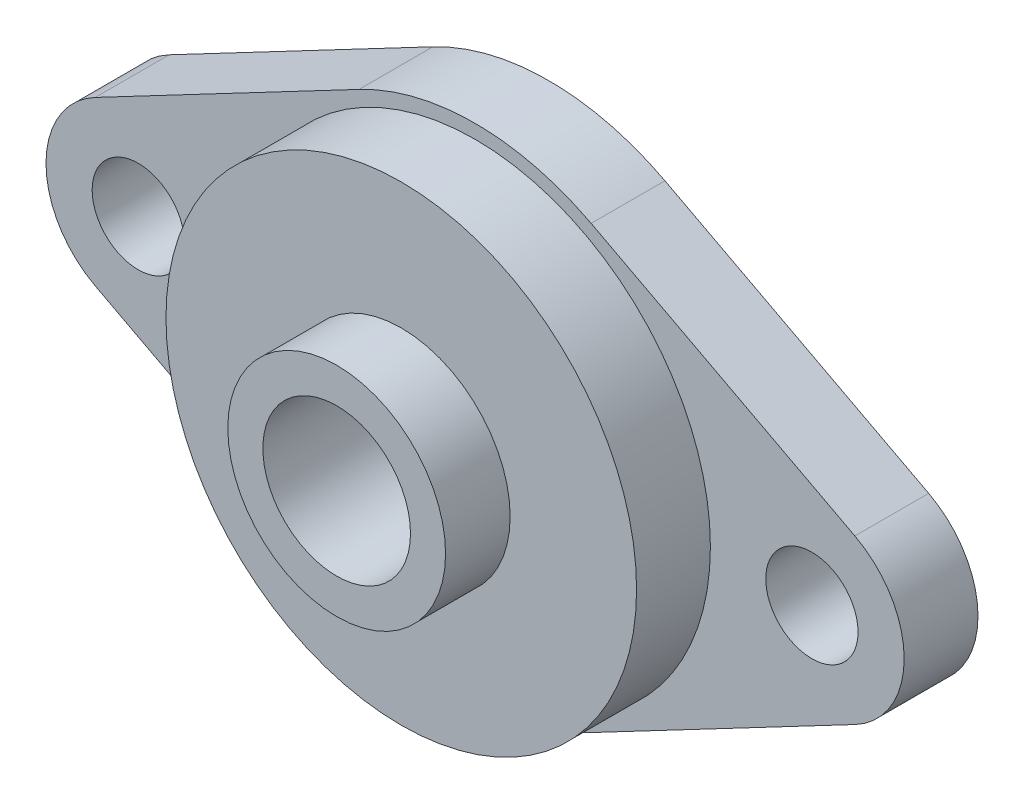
ISO-10303-21;
HEADER;
FILE_DESCRIPTION(('STEP AP214'),'2;1');
FILE_NAME('part.step','',(''),(''),'','','');
FILE_SCHEMA(('AUTOMOTIVE_DESIGN { 1 0 10303 214 1 1 1 1 }'));
ENDSEC;
DATA;
#1=APPLICATION_CONTEXT('core data for automotive mechanical design processes');
#2=APPLICATION_PROTOCOL_DEFINITION('international standard','automotive_design',2000,#1);
#3=PRODUCT_CONTEXT('',#1,'mechanical');
#4=PRODUCT('Part','Part','',(#3));
#5=PRODUCT_RELATED_PRODUCT_CATEGORY('part','',(#4));
#6=PRODUCT_DEFINITION_FORMATION('','',#4);
#7=PRODUCT_DEFINITION_CONTEXT('part definition',#1,'design');
#8=PRODUCT_DEFINITION('design','',#6,#7);
#9=PRODUCT_DEFINITION_SHAPE('','',#8);
#10=(LENGTH_UNIT() NAMED_UNIT(*) SI_UNIT(.MILLI.,.METRE.));
#11=(NAMED_UNIT(*) PLANE_ANGLE_UNIT() SI_UNIT($,.RADIAN.));
#12=(NAMED_UNIT(*) SI_UNIT($,.STERADIAN.) SOLID_ANGLE_UNIT());
#13=UNCERTAINTY_MEASURE_WITH_UNIT(LENGTH_MEASURE(1.E-05),#10,'distance_accuracy_value','');
#14=(GEOMETRIC_REPRESENTATION_CONTEXT(3) GLOBAL_UNCERTAINTY_ASSIGNED_CONTEXT((#13)) GLOBAL_UNIT_ASSIGNED_CONTEXT((#10,
#11,#12)) REPRESENTATION_CONTEXT('',''));
#15=CARTESIAN_POINT('',(0.,0.,0.));
#16=DIRECTION('',(0.,0.,1.));
#17=DIRECTION('',(1.,0.,0.));
#18=AXIS2_PLACEMENT_3D('',#15,#16,#17);
#19=CARTESIAN_POINT('',(0.,0.,8.));
#20=DIRECTION('',(0.,0.,1.));
#21=DIRECTION('',(1.,0.,0.));
#22=AXIS2_PLACEMENT_3D('',#19,#20,#21);
#23=PLANE('',#22);
#24=CARTESIAN_POINT('',(0.,0.,8.));
#25=DIRECTION('',(0.,0.,1.));
#26=DIRECTION('',(1.,0.,0.));
#27=AXIS2_PLACEMENT_3D('',#24,#25,#26);
#28=CIRCLE('',#27,12.75);
#29=CARTESIAN_POINT('',(12.75,0.,8.));
#30=VERTEX_POINT('',#29);
#31=EDGE_CURVE('E196',#30,#30,#28,.T.);
#32=ORIENTED_EDGE('',*,*,#31,.T.);
#33=EDGE_LOOP('',(#32));
#34=FACE_BOUND('',#33,.T.);
#35=CARTESIAN_POINT('',(0.,0.,8.));
#36=DIRECTION('',(0.,0.,1.));
#37=DIRECTION('',(1.,0.,0.));
#38=AXIS2_PLACEMENT_3D('',#35,#36,#37);
#39=CIRCLE('',#38,5.9);
#40=CARTESIAN_POINT('',(5.9,0.,8.));
#41=VERTEX_POINT('',#40);
#42=EDGE_CURVE('E202',#41,#41,#39,.T.);
#43=ORIENTED_EDGE('',*,*,#42,.F.);
#44=EDGE_LOOP('',(#43));
#45=FACE_BOUND('',#44,.T.);
#46=ADVANCED_FACE('F32',(#34,#45),#23,.T.);
#47=CARTESIAN_POINT('',(-18.25,0.,4.));
#48=DIRECTION('',(0.,0.,-1.));
#49=DIRECTION('',(-1.,0.,0.));
#50=AXIS2_PLACEMENT_3D('',#47,#48,#49);
#51=PLANE('',#50);
#52=CARTESIAN_POINT('',(-18.25,0.,4.));
#53=DIRECTION('',(0.,0.,1.));
#54=DIRECTION('',(-1.,0.,0.));
#55=AXIS2_PLACEMENT_3D('',#52,#53,#54);
#56=CIRCLE('',#55,2.5);
#57=CARTESIAN_POINT('',(-20.75,0.,4.));
#58=VERTEX_POINT('',#57);
#59=EDGE_CURVE('E190',#58,#58,#56,.T.);
#60=ORIENTED_EDGE('',*,*,#59,.F.);
#61=EDGE_LOOP('',(#60));
#62=FACE_BOUND('',#61,.T.);
#63=CARTESIAN_POINT('',(-18.25,0.,4.));
#64=DIRECTION('',(0.,0.,1.));
#65=DIRECTION('',(-1.,0.,0.));
#66=AXIS2_PLACEMENT_3D('',#63,#64,#65);
#67=CIRCLE('',#66,5.);
#68=CARTESIAN_POINT('',(-20.5787671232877,4.4245727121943,4.));
#69=VERTEX_POINT('',#68);
#70=CARTESIAN_POINT('',(-20.5787671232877,-4.4245727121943,4.));
#71=VERTEX_POINT('',#70);
#72=EDGE_CURVE('E146',#69,#71,#67,.T.);
#73=ORIENTED_EDGE('',*,*,#72,.T.);
#74=DIRECTION('',(0.884914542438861,-0.465753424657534,0.));
#75=VECTOR('',#74,1.);
#76=CARTESIAN_POINT('',(-6.28767123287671,-11.9463463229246,4.));
#77=LINE('',#76,#75);
#78=CARTESIAN_POINT('',(-6.28767123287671,-11.9463463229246,4.));
#79=VERTEX_POINT('',#78);
#80=EDGE_CURVE('E93',#71,#79,#77,.T.);
#81=ORIENTED_EDGE('',*,*,#80,.T.);
#82=CARTESIAN_POINT('',(0.,0.,4.));
#83=DIRECTION('',(0.,0.,1.));
#84=DIRECTION('',(1.,0.,0.));
#85=AXIS2_PLACEMENT_3D('',#82,#83,#84);
#86=CIRCLE('',#85,13.5);
#87=CARTESIAN_POINT('',(6.28767123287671,-11.9463463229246,4.));
#88=VERTEX_POINT('',#87);
#89=EDGE_CURVE('E178',#79,#88,#86,.T.);
#90=ORIENTED_EDGE('',*,*,#89,.T.);
#91=DIRECTION('',(0.884914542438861,0.465753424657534,0.));
#92=VECTOR('',#91,1.);
#93=CARTESIAN_POINT('',(6.28767123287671,-11.9463463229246,4.));
#94=LINE('',#93,#92);
#95=CARTESIAN_POINT('',(20.5787671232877,-4.4245727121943,4.));
#96=VERTEX_POINT('',#95);
#97=EDGE_CURVE('E177',#88,#96,#94,.T.);
#98=ORIENTED_EDGE('',*,*,#97,.T.);
#99=CARTESIAN_POINT('',(18.25,0.,4.));
#100=DIRECTION('',(0.,0.,1.));
#101=DIRECTION('',(1.,0.,0.));
#102=AXIS2_PLACEMENT_3D('',#99,#100,#101);
#103=CIRCLE('',#102,5.);
#104=CARTESIAN_POINT('',(20.5787671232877,4.4245727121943,4.));
#105=VERTEX_POINT('',#104);
#106=EDGE_CURVE('E113',#96,#105,#103,.T.);
#107=ORIENTED_EDGE('',*,*,#106,.T.);
#108=DIRECTION('',(-0.884914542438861,0.465753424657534,0.));
#109=VECTOR('',#108,1.);
#110=CARTESIAN_POINT('',(6.28767123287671,11.9463463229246,4.));
#111=LINE('',#110,#109);
#112=CARTESIAN_POINT('',(6.28767123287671,11.9463463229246,4.));
#113=VERTEX_POINT('',#112);
#114=EDGE_CURVE('E106',#105,#113,#111,.T.);
#115=ORIENTED_EDGE('',*,*,#114,.T.);
#116=CARTESIAN_POINT('',(0.,0.,4.));
#117=DIRECTION('',(0.,0.,1.));
#118=DIRECTION('',(1.,0.,0.));
#119=AXIS2_PLACEMENT_3D('',#116,#117,#118);
#120=CIRCLE('',#119,13.5);
#121=CARTESIAN_POINT('',(-6.28767123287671,11.9463463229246,4.));
#122=VERTEX_POINT('',#121);
#123=EDGE_CURVE('E111',#113,#122,#120,.T.);
#124=ORIENTED_EDGE('',*,*,#123,.T.);
#125=DIRECTION('',(-0.884914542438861,-0.465753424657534,0.));
#126=VECTOR('',#125,1.);
#127=CARTESIAN_POINT('',(-6.28767123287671,11.9463463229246,4.));
#128=LINE('',#127,#126);
#129=EDGE_CURVE('E49',#122,#69,#128,.T.);
#130=ORIENTED_EDGE('',*,*,#129,.T.);
#131=EDGE_LOOP('',(#73,#81,#90,#98,#107,#115,#124,#130));
#132=FACE_BOUND('',#131,.T.);
#133=CARTESIAN_POINT('',(18.25,0.,4.));
#134=DIRECTION('',(0.,0.,1.));
#135=DIRECTION('',(1.,0.,0.));
#136=AXIS2_PLACEMENT_3D('',#133,#134,#135);
#137=CIRCLE('',#136,2.5);
#138=CARTESIAN_POINT('',(20.75,0.,4.));
#139=VERTEX_POINT('',#138);
#140=EDGE_CURVE('E186',#139,#139,#137,.T.);
#141=ORIENTED_EDGE('',*,*,#140,.F.);
#142=EDGE_LOOP('',(#141));
#143=FACE_BOUND('',#142,.T.);
#144=CARTESIAN_POINT('',(0.,0.,4.));
#145=DIRECTION('',(0.,0.,-1.));
#146=DIRECTION('',(-1.,0.,0.));
#147=AXIS2_PLACEMENT_3D('',#144,#145,#146);
#148=CIRCLE('',#147,12.75);
#149=CARTESIAN_POINT('',(-12.75,0.,4.));
#150=VERTEX_POINT('',#149);
#151=EDGE_CURVE('E11',#150,#150,#148,.F.);
#152=ORIENTED_EDGE('',*,*,#151,.F.);
#153=EDGE_LOOP('',(#152));
#154=FACE_BOUND('',#153,.T.);
#155=ADVANCED_FACE('F108',(#62,#132,#143,#154),#51,.F.);
#156=CARTESIAN_POINT('',(-18.25,0.,0.));
#157=DIRECTION('',(0.,0.,-1.));
#158=DIRECTION('',(-1.,0.,0.));
#159=AXIS2_PLACEMENT_3D('',#156,#157,#158);
#160=PLANE('',#159);
#161=CARTESIAN_POINT('',(18.25,0.,0.));
#162=DIRECTION('',(0.,0.,1.));
#163=DIRECTION('',(1.,0.,0.));
#164=AXIS2_PLACEMENT_3D('',#161,#162,#163);
#165=CIRCLE('',#164,2.5);
#166=CARTESIAN_POINT('',(20.75,0.,0.));
#167=VERTEX_POINT('',#166);
#168=EDGE_CURVE('E187',#167,#167,#165,.T.);
#169=ORIENTED_EDGE('',*,*,#168,.T.);
#170=EDGE_LOOP('',(#169));
#171=FACE_BOUND('',#170,.T.);
#172=CARTESIAN_POINT('',(-18.25,0.,0.));
#173=DIRECTION('',(0.,0.,1.));
#174=DIRECTION('',(-1.,0.,0.));
#175=AXIS2_PLACEMENT_3D('',#172,#173,#174);
#176=CIRCLE('',#175,5.);
#177=CARTESIAN_POINT('',(-20.5787671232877,4.4245727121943,0.));
#178=VERTEX_POINT('',#177);
#179=CARTESIAN_POINT('',(-20.5787671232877,-4.4245727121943,0.));
#180=VERTEX_POINT('',#179);
#181=EDGE_CURVE('E131',#178,#180,#176,.T.);
#182=ORIENTED_EDGE('',*,*,#181,.F.);
#183=DIRECTION('',(-0.884914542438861,-0.465753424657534,0.));
#184=VECTOR('',#183,1.);
#185=CARTESIAN_POINT('',(-6.28767123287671,11.9463463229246,0.));
#186=LINE('',#185,#184);
#187=CARTESIAN_POINT('',(-6.28767123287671,11.9463463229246,0.));
#188=VERTEX_POINT('',#187);
#189=EDGE_CURVE('E84',#188,#178,#186,.T.);
#190=ORIENTED_EDGE('',*,*,#189,.F.);
#191=CARTESIAN_POINT('',(0.,0.,0.));
#192=DIRECTION('',(0.,0.,1.));
#193=DIRECTION('',(1.,0.,0.));
#194=AXIS2_PLACEMENT_3D('',#191,#192,#193);
#195=CIRCLE('',#194,13.5);
#196=CARTESIAN_POINT('',(6.28767123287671,11.9463463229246,0.));
#197=VERTEX_POINT('',#196);
#198=EDGE_CURVE('E78',#197,#188,#195,.T.);
#199=ORIENTED_EDGE('',*,*,#198,.F.);
#200=DIRECTION('',(-0.884914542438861,0.465753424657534,0.));
#201=VECTOR('',#200,1.);
#202=CARTESIAN_POINT('',(6.28767123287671,11.9463463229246,0.));
#203=LINE('',#202,#201);
#204=CARTESIAN_POINT('',(20.5787671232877,4.4245727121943,0.));
#205=VERTEX_POINT('',#204);
#206=EDGE_CURVE('E121',#205,#197,#203,.T.);
#207=ORIENTED_EDGE('',*,*,#206,.F.);
#208=CARTESIAN_POINT('',(18.25,0.,0.));
#209=DIRECTION('',(0.,0.,1.));
#210=DIRECTION('',(1.,0.,0.));
#211=AXIS2_PLACEMENT_3D('',#208,#209,#210);
#212=CIRCLE('',#211,5.);
#213=CARTESIAN_POINT('',(20.5787671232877,-4.4245727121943,0.));
#214=VERTEX_POINT('',#213);
#215=EDGE_CURVE('E141',#214,#205,#212,.T.);
#216=ORIENTED_EDGE('',*,*,#215,.F.);
#217=DIRECTION('',(0.884914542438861,0.465753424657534,0.));
#218=VECTOR('',#217,1.);
#219=CARTESIAN_POINT('',(6.28767123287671,-11.9463463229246,0.));
#220=LINE('',#219,#218);
#221=CARTESIAN_POINT('',(6.28767123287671,-11.9463463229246,0.));
#222=VERTEX_POINT('',#221);
#223=EDGE_CURVE('E139',#222,#214,#220,.T.);
#224=ORIENTED_EDGE('',*,*,#223,.F.);
#225=CARTESIAN_POINT('',(0.,0.,0.));
#226=DIRECTION('',(0.,0.,1.));
#227=DIRECTION('',(1.,0.,0.));
#228=AXIS2_PLACEMENT_3D('',#225,#226,#227);
#229=CIRCLE('',#228,13.5);
#230=CARTESIAN_POINT('',(-6.28767123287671,-11.9463463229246,0.));
#231=VERTEX_POINT('',#230);
#232=EDGE_CURVE('E137',#231,#222,#229,.T.);
#233=ORIENTED_EDGE('',*,*,#232,.F.);
#234=DIRECTION('',(0.884914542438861,-0.465753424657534,0.));
#235=VECTOR('',#234,1.);
#236=CARTESIAN_POINT('',(-6.28767123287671,-11.9463463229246,0.));
#237=LINE('',#236,#235);
#238=EDGE_CURVE('E134',#180,#231,#237,.T.);
#239=ORIENTED_EDGE('',*,*,#238,.F.);
#240=EDGE_LOOP('',(#182,#190,#199,#207,#216,#224,#233,#239));
#241=FACE_BOUND('',#240,.T.);
#242=CARTESIAN_POINT('',(0.,0.,0.));
#243=DIRECTION('',(0.,0.,1.));
#244=DIRECTION('',(1.,0.,0.));
#245=AXIS2_PLACEMENT_3D('',#242,#243,#244);
#246=CIRCLE('',#245,4.);
#247=CARTESIAN_POINT('',(4.,0.,0.));
#248=VERTEX_POINT('',#247);
#249=EDGE_CURVE('E135',#248,#248,#246,.T.);
#250=ORIENTED_EDGE('',*,*,#249,.T.);
#251=EDGE_LOOP('',(#250));
#252=FACE_BOUND('',#251,.T.);
#253=CARTESIAN_POINT('',(-18.25,0.,0.));
#254=DIRECTION('',(0.,0.,1.));
#255=DIRECTION('',(-1.,0.,0.));
#256=AXIS2_PLACEMENT_3D('',#253,#254,#255);
#257=CIRCLE('',#256,2.5);
#258=CARTESIAN_POINT('',(-20.75,0.,0.));
#259=VERTEX_POINT('',#258);
#260=EDGE_CURVE('E193',#259,#259,#257,.T.);
#261=ORIENTED_EDGE('',*,*,#260,.T.);
#262=EDGE_LOOP('',(#261));
#263=FACE_BOUND('',#262,.T.);
#264=ADVANCED_FACE('F164',(#171,#241,#252,#263),#160,.T.);
#265=CARTESIAN_POINT('',(-18.25,0.,4.));
#266=DIRECTION('',(0.,0.,-1.));
#267=DIRECTION('',(-1.,0.,0.));
#268=AXIS2_PLACEMENT_3D('',#265,#266,#267);
#269=CYLINDRICAL_SURFACE('',#268,5.);
#270=ORIENTED_EDGE('',*,*,#181,.T.);
#271=DIRECTION('',(0.,0.,-1.));
#272=VECTOR('',#271,1.);
#273=CARTESIAN_POINT('',(-20.5787671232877,-4.4245727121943,4.));
#274=LINE('',#273,#272);
#275=EDGE_CURVE('E41',#71,#180,#274,.T.);
#276=ORIENTED_EDGE('',*,*,#275,.F.);
#277=ORIENTED_EDGE('',*,*,#72,.F.);
#278=DIRECTION('',(0.,0.,-1.));
#279=VECTOR('',#278,1.);
#280=CARTESIAN_POINT('',(-20.5787671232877,4.4245727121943,4.));
#281=LINE('',#280,#279);
#282=EDGE_CURVE('E127',#69,#178,#281,.T.);
#283=ORIENTED_EDGE('',*,*,#282,.T.);
#284=EDGE_LOOP('',(#270,#276,#277,#283));
#285=FACE_BOUND('',#284,.T.);
#286=ADVANCED_FACE('F34',(#285),#269,.T.);
#287=CARTESIAN_POINT('',(-6.28767123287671,-11.9463463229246,4.));
#288=DIRECTION('',(0.465753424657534,0.884914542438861,0.));
#289=DIRECTION('',(-0.884914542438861,0.465753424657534,0.));
#290=AXIS2_PLACEMENT_3D('',#287,#288,#289);
#291=PLANE('',#290);
#292=ORIENTED_EDGE('',*,*,#238,.T.);
#293=DIRECTION('',(0.,0.,-1.));
#294=VECTOR('',#293,1.);
#295=CARTESIAN_POINT('',(-6.28767123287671,-11.9463463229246,4.));
#296=LINE('',#295,#294);
#297=EDGE_CURVE('E156',#79,#231,#296,.T.);
#298=ORIENTED_EDGE('',*,*,#297,.F.);
#299=ORIENTED_EDGE('',*,*,#80,.F.);
#300=ORIENTED_EDGE('',*,*,#275,.T.);
#301=EDGE_LOOP('',(#292,#298,#299,#300));
#302=FACE_BOUND('',#301,.T.);
#303=ADVANCED_FACE('F159',(#302),#291,.F.);
#304=CARTESIAN_POINT('',(0.,0.,4.));
#305=DIRECTION('',(0.,0.,-1.));
#306=DIRECTION('',(-1.,0.,0.));
#307=AXIS2_PLACEMENT_3D('',#304,#305,#306);
#308=CYLINDRICAL_SURFACE('',#307,13.5);
#309=ORIENTED_EDGE('',*,*,#232,.T.);
#310=DIRECTION('',(0.,0.,-1.));
#311=VECTOR('',#310,1.);
#312=CARTESIAN_POINT('',(6.28767123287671,-11.9463463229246,4.));
#313=LINE('',#312,#311);
#314=EDGE_CURVE('E153',#88,#222,#313,.T.);
#315=ORIENTED_EDGE('',*,*,#314,.F.);
#316=ORIENTED_EDGE('',*,*,#89,.F.);
#317=ORIENTED_EDGE('',*,*,#297,.T.);
#318=EDGE_LOOP('',(#309,#315,#316,#317));
#319=FACE_BOUND('',#318,.T.);
#320=ADVANCED_FACE('F171',(#319),#308,.T.);
#321=CARTESIAN_POINT('',(6.28767123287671,-11.9463463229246,4.));
#322=DIRECTION('',(-0.465753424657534,0.884914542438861,0.));
#323=DIRECTION('',(-0.884914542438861,-0.465753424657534,0.));
#324=AXIS2_PLACEMENT_3D('',#321,#322,#323);
#325=PLANE('',#324);
#326=ORIENTED_EDGE('',*,*,#223,.T.);
#327=DIRECTION('',(0.,0.,-1.));
#328=VECTOR('',#327,1.);
#329=CARTESIAN_POINT('',(20.5787671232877,-4.4245727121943,4.));
#330=LINE('',#329,#328);
#331=EDGE_CURVE('E150',#96,#214,#330,.T.);
#332=ORIENTED_EDGE('',*,*,#331,.F.);
#333=ORIENTED_EDGE('',*,*,#97,.F.);
#334=ORIENTED_EDGE('',*,*,#314,.T.);
#335=EDGE_LOOP('',(#326,#332,#333,#334));
#336=FACE_BOUND('',#335,.T.);
#337=ADVANCED_FACE('F175',(#336),#325,.F.);
#338=CARTESIAN_POINT('',(18.25,0.,4.));
#339=DIRECTION('',(0.,0.,-1.));
#340=DIRECTION('',(-1.,0.,0.));
#341=AXIS2_PLACEMENT_3D('',#338,#339,#340);
#342=CYLINDRICAL_SURFACE('',#341,5.);
#343=ORIENTED_EDGE('',*,*,#215,.T.);
#344=DIRECTION('',(0.,0.,-1.));
#345=VECTOR('',#344,1.);
#346=CARTESIAN_POINT('',(20.5787671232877,4.4245727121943,4.));
#347=LINE('',#346,#345);
#348=EDGE_CURVE('E122',#105,#205,#347,.T.);
#349=ORIENTED_EDGE('',*,*,#348,.F.);
#350=ORIENTED_EDGE('',*,*,#106,.F.);
#351=ORIENTED_EDGE('',*,*,#331,.T.);
#352=EDGE_LOOP('',(#343,#349,#350,#351));
#353=FACE_BOUND('',#352,.T.);
#354=ADVANCED_FACE('F258',(#353),#342,.T.);
#355=CARTESIAN_POINT('',(6.28767123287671,11.9463463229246,4.));
#356=DIRECTION('',(-0.465753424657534,-0.884914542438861,0.));
#357=DIRECTION('',(0.884914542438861,-0.465753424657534,0.));
#358=AXIS2_PLACEMENT_3D('',#355,#356,#357);
#359=PLANE('',#358);
#360=ORIENTED_EDGE('',*,*,#206,.T.);
#361=DIRECTION('',(0.,0.,-1.));
#362=VECTOR('',#361,1.);
#363=CARTESIAN_POINT('',(6.28767123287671,11.9463463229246,4.));
#364=LINE('',#363,#362);
#365=EDGE_CURVE('E118',#113,#197,#364,.T.);
#366=ORIENTED_EDGE('',*,*,#365,.F.);
#367=ORIENTED_EDGE('',*,*,#114,.F.);
#368=ORIENTED_EDGE('',*,*,#348,.T.);
#369=EDGE_LOOP('',(#360,#366,#367,#368));
#370=FACE_BOUND('',#369,.T.);
#371=ADVANCED_FACE('F119',(#370),#359,.F.);
#372=CARTESIAN_POINT('',(0.,0.,4.));
#373=DIRECTION('',(0.,0.,-1.));
#374=DIRECTION('',(-1.,0.,0.));
#375=AXIS2_PLACEMENT_3D('',#372,#373,#374);
#376=CYLINDRICAL_SURFACE('',#375,13.5);
#377=ORIENTED_EDGE('',*,*,#198,.T.);
#378=DIRECTION('',(0.,0.,-1.));
#379=VECTOR('',#378,1.);
#380=CARTESIAN_POINT('',(-6.28767123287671,11.9463463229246,4.));
#381=LINE('',#380,#379);
#382=EDGE_CURVE('E123',#122,#188,#381,.T.);
#383=ORIENTED_EDGE('',*,*,#382,.F.);
#384=ORIENTED_EDGE('',*,*,#123,.F.);
#385=ORIENTED_EDGE('',*,*,#365,.T.);
#386=EDGE_LOOP('',(#377,#383,#384,#385));
#387=FACE_BOUND('',#386,.T.);
#388=ADVANCED_FACE('F125',(#387),#376,.T.);
#389=CARTESIAN_POINT('',(-6.28767123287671,11.9463463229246,4.));
#390=DIRECTION('',(0.465753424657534,-0.884914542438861,0.));
#391=DIRECTION('',(0.884914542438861,0.465753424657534,0.));
#392=AXIS2_PLACEMENT_3D('',#389,#390,#391);
#393=PLANE('',#392);
#394=ORIENTED_EDGE('',*,*,#189,.T.);
#395=ORIENTED_EDGE('',*,*,#282,.F.);
#396=ORIENTED_EDGE('',*,*,#129,.F.);
#397=ORIENTED_EDGE('',*,*,#382,.T.);
#398=EDGE_LOOP('',(#394,#395,#396,#397));
#399=FACE_BOUND('',#398,.T.);
#400=ADVANCED_FACE('F246',(#399),#393,.F.);
#401=CARTESIAN_POINT('',(0.,0.,4.));
#402=DIRECTION('',(0.,0.,-1.));
#403=DIRECTION('',(-1.,0.,0.));
#404=AXIS2_PLACEMENT_3D('',#401,#402,#403);
#405=CYLINDRICAL_SURFACE('',#404,4.);
#406=ORIENTED_EDGE('',*,*,#249,.F.);
#407=EDGE_LOOP('',(#406));
#408=FACE_BOUND('',#407,.T.);
#409=CARTESIAN_POINT('',(0.,0.,11.5));
#410=DIRECTION('',(0.,0.,1.));
#411=DIRECTION('',(1.,0.,0.));
#412=AXIS2_PLACEMENT_3D('',#409,#410,#411);
#413=CIRCLE('',#412,4.);
#414=CARTESIAN_POINT('',(4.,0.,11.5));
#415=VERTEX_POINT('',#414);
#416=EDGE_CURVE('E205',#415,#415,#413,.T.);
#417=ORIENTED_EDGE('',*,*,#416,.T.);
#418=EDGE_LOOP('',(#417));
#419=FACE_BOUND('',#418,.T.);
#420=ADVANCED_FACE('F211',(#408,#419),#405,.F.);
#421=CARTESIAN_POINT('',(18.25,0.,4.));
#422=DIRECTION('',(0.,0.,-1.));
#423=DIRECTION('',(-1.,0.,0.));
#424=AXIS2_PLACEMENT_3D('',#421,#422,#423);
#425=CYLINDRICAL_SURFACE('',#424,2.5);
#426=ORIENTED_EDGE('',*,*,#140,.T.);
#427=EDGE_LOOP('',(#426));
#428=FACE_BOUND('',#427,.T.);
#429=ORIENTED_EDGE('',*,*,#168,.F.);
#430=EDGE_LOOP('',(#429));
#431=FACE_BOUND('',#430,.T.);
#432=ADVANCED_FACE('F240',(#428,#431),#425,.F.);
#433=CARTESIAN_POINT('',(-18.25,0.,4.));
#434=DIRECTION('',(0.,0.,-1.));
#435=DIRECTION('',(-1.,0.,0.));
#436=AXIS2_PLACEMENT_3D('',#433,#434,#435);
#437=CYLINDRICAL_SURFACE('',#436,2.5);
#438=ORIENTED_EDGE('',*,*,#59,.T.);
#439=EDGE_LOOP('',(#438));
#440=FACE_BOUND('',#439,.T.);
#441=ORIENTED_EDGE('',*,*,#260,.F.);
#442=EDGE_LOOP('',(#441));
#443=FACE_BOUND('',#442,.T.);
#444=ADVANCED_FACE('F225',(#440,#443),#437,.F.);
#445=CARTESIAN_POINT('',(0.,0.,8.));
#446=DIRECTION('',(0.,0.,-1.));
#447=DIRECTION('',(-1.,0.,0.));
#448=AXIS2_PLACEMENT_3D('',#445,#446,#447);
#449=CYLINDRICAL_SURFACE('',#448,12.75);
#450=ORIENTED_EDGE('',*,*,#31,.F.);
#451=EDGE_LOOP('',(#450));
#452=FACE_BOUND('',#451,.T.);
#453=ORIENTED_EDGE('',*,*,#151,.T.);
#454=EDGE_LOOP('',(#453));
#455=FACE_BOUND('',#454,.T.);
#456=ADVANCED_FACE('F216',(#452,#455),#449,.T.);
#457=CARTESIAN_POINT('',(0.,0.,11.5));
#458=DIRECTION('',(0.,0.,1.));
#459=DIRECTION('',(1.,0.,0.));
#460=AXIS2_PLACEMENT_3D('',#457,#458,#459);
#461=PLANE('',#460);
#462=CARTESIAN_POINT('',(0.,0.,11.5));
#463=DIRECTION('',(0.,0.,1.));
#464=DIRECTION('',(1.,0.,0.));
#465=AXIS2_PLACEMENT_3D('',#462,#463,#464);
#466=CIRCLE('',#465,5.9);
#467=CARTESIAN_POINT('',(5.9,0.,11.5));
#468=VERTEX_POINT('',#467);
#469=EDGE_CURVE('E201',#468,#468,#466,.T.);
#470=ORIENTED_EDGE('',*,*,#469,.T.);
#471=EDGE_LOOP('',(#470));
#472=FACE_BOUND('',#471,.T.);
#473=ORIENTED_EDGE('',*,*,#416,.F.);
#474=EDGE_LOOP('',(#473));
#475=FACE_BOUND('',#474,.T.);
#476=ADVANCED_FACE('F213',(#472,#475),#461,.T.);
#477=CARTESIAN_POINT('',(0.,0.,11.5));
#478=DIRECTION('',(0.,0.,-1.));
#479=DIRECTION('',(-1.,0.,0.));
#480=AXIS2_PLACEMENT_3D('',#477,#478,#479);
#481=CYLINDRICAL_SURFACE('',#480,5.9);
#482=ORIENTED_EDGE('',*,*,#469,.F.);
#483=EDGE_LOOP('',(#482));
#484=FACE_BOUND('',#483,.T.);
#485=ORIENTED_EDGE('',*,*,#42,.T.);
#486=EDGE_LOOP('',(#485));
#487=FACE_BOUND('',#486,.T.);
#488=ADVANCED_FACE('F215',(#484,#487),#481,.T.);
#489=CLOSED_SHELL('',(#46,#155,#264,#286,#303,#320,#337,#354,#371,#388,#400,#420,#432,#444,#456,
#476,#488));
#490=MANIFOLD_SOLID_BREP('B2',#489);
#491=ADVANCED_BREP_SHAPE_REPRESENTATION('',(#18,#490),#14);
#492=SHAPE_DEFINITION_REPRESENTATION(#9,#491);
ENDSEC;
END-ISO-10303-21;
